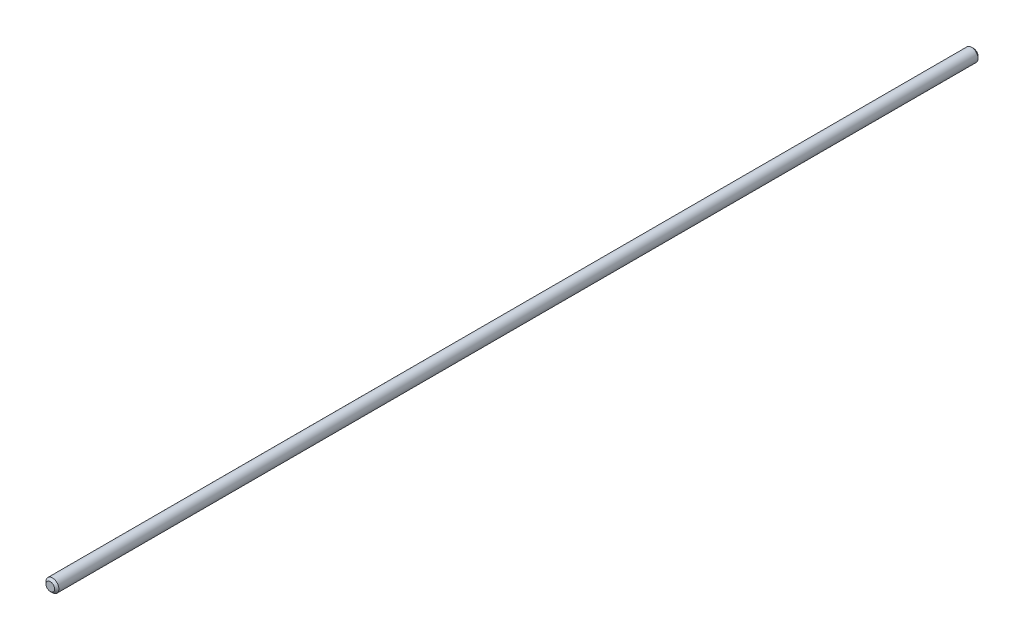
ISO-10303-21;
HEADER;
FILE_DESCRIPTION(('STEP AP214'),'2;1');
FILE_NAME('part.step','',(''),(''),'','','');
FILE_SCHEMA(('AUTOMOTIVE_DESIGN { 1 0 10303 214 1 1 1 1 }'));
ENDSEC;
DATA;
#1=APPLICATION_CONTEXT('core data for automotive mechanical design processes');
#2=APPLICATION_PROTOCOL_DEFINITION('international standard','automotive_design',2000,#1);
#3=PRODUCT_CONTEXT('',#1,'mechanical');
#4=PRODUCT('Part','Part','',(#3));
#5=PRODUCT_RELATED_PRODUCT_CATEGORY('part','',(#4));
#6=PRODUCT_DEFINITION_FORMATION('','',#4);
#7=PRODUCT_DEFINITION_CONTEXT('part definition',#1,'design');
#8=PRODUCT_DEFINITION('design','',#6,#7);
#9=PRODUCT_DEFINITION_SHAPE('','',#8);
#10=(LENGTH_UNIT() NAMED_UNIT(*) SI_UNIT(.MILLI.,.METRE.));
#11=(NAMED_UNIT(*) PLANE_ANGLE_UNIT() SI_UNIT($,.RADIAN.));
#12=(NAMED_UNIT(*) SI_UNIT($,.STERADIAN.) SOLID_ANGLE_UNIT());
#13=UNCERTAINTY_MEASURE_WITH_UNIT(LENGTH_MEASURE(1.E-05),#10,'distance_accuracy_value','');
#14=(GEOMETRIC_REPRESENTATION_CONTEXT(3) GLOBAL_UNCERTAINTY_ASSIGNED_CONTEXT((#13)) GLOBAL_UNIT_ASSIGNED_CONTEXT((#10,
#11,#12)) REPRESENTATION_CONTEXT('',''));
#15=CARTESIAN_POINT('',(0.,0.,0.));
#16=DIRECTION('',(0.,0.,1.));
#17=DIRECTION('',(1.,0.,0.));
#18=AXIS2_PLACEMENT_3D('',#15,#16,#17);
#19=CARTESIAN_POINT('',(0.,0.,430.));
#20=DIRECTION('',(0.,0.,-1.));
#21=DIRECTION('',(-1.,0.,0.));
#22=AXIS2_PLACEMENT_3D('',#19,#20,#21);
#23=CYLINDRICAL_SURFACE('',#22,3.);
#24=CARTESIAN_POINT('',(0.,0.,1.00000000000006));
#25=DIRECTION('',(0.,0.,1.));
#26=DIRECTION('',(1.,0.,0.));
#27=AXIS2_PLACEMENT_3D('',#24,#25,#26);
#28=CIRCLE('',#27,3.);
#29=CARTESIAN_POINT('',(3.,0.,1.00000000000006));
#30=VERTEX_POINT('',#29);
#31=EDGE_CURVE('E35',#30,#30,#28,.T.);
#32=ORIENTED_EDGE('',*,*,#31,.T.);
#33=EDGE_LOOP('',(#32));
#34=FACE_BOUND('',#33,.T.);
#35=CARTESIAN_POINT('',(0.,0.,429.));
#36=DIRECTION('',(0.,0.,1.));
#37=DIRECTION('',(1.,0.,0.));
#38=AXIS2_PLACEMENT_3D('',#35,#36,#37);
#39=CIRCLE('',#38,3.);
#40=CARTESIAN_POINT('',(3.,0.,429.));
#41=VERTEX_POINT('',#40);
#42=EDGE_CURVE('E39',#41,#41,#39,.F.);
#43=ORIENTED_EDGE('',*,*,#42,.T.);
#44=EDGE_LOOP('',(#43));
#45=FACE_BOUND('',#44,.T.);
#46=ADVANCED_FACE('F25',(#34,#45),#23,.T.);
#47=CARTESIAN_POINT('',(0.,0.,430.));
#48=DIRECTION('',(0.,0.,1.));
#49=DIRECTION('',(1.,0.,0.));
#50=AXIS2_PLACEMENT_3D('',#47,#48,#49);
#51=PLANE('',#50);
#52=CARTESIAN_POINT('',(0.,0.,430.));
#53=DIRECTION('',(0.,0.,1.));
#54=DIRECTION('',(1.,0.,0.));
#55=AXIS2_PLACEMENT_3D('',#52,#53,#54);
#56=CIRCLE('',#55,2.00000000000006);
#57=CARTESIAN_POINT('',(2.00000000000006,0.,430.));
#58=VERTEX_POINT('',#57);
#59=EDGE_CURVE('E10',#58,#58,#56,.T.);
#60=ORIENTED_EDGE('',*,*,#59,.T.);
#61=EDGE_LOOP('',(#60));
#62=FACE_BOUND('',#61,.T.);
#63=ADVANCED_FACE('F58',(#62),#51,.T.);
#64=CARTESIAN_POINT('',(0.,0.,0.));
#65=DIRECTION('',(0.,0.,1.));
#66=DIRECTION('',(1.,0.,0.));
#67=AXIS2_PLACEMENT_3D('',#64,#65,#66);
#68=PLANE('',#67);
#69=CARTESIAN_POINT('',(0.,0.,0.));
#70=DIRECTION('',(0.,0.,1.));
#71=DIRECTION('',(1.,0.,0.));
#72=AXIS2_PLACEMENT_3D('',#69,#70,#71);
#73=CIRCLE('',#72,1.99999999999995);
#74=CARTESIAN_POINT('',(1.99999999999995,0.,0.));
#75=VERTEX_POINT('',#74);
#76=EDGE_CURVE('E31',#75,#75,#73,.F.);
#77=ORIENTED_EDGE('',*,*,#76,.T.);
#78=EDGE_LOOP('',(#77));
#79=FACE_BOUND('',#78,.T.);
#80=ADVANCED_FACE('F54',(#79),#68,.F.);
#81=CARTESIAN_POINT('',(0.,0.,1.00000000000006));
#82=DIRECTION('',(0.,0.,1.));
#83=DIRECTION('',(1.,0.,0.));
#84=AXIS2_PLACEMENT_3D('',#81,#82,#83);
#85=CONICAL_SURFACE('',#84,3.,0.785398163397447);
#86=ORIENTED_EDGE('',*,*,#76,.F.);
#87=EDGE_LOOP('',(#86));
#88=FACE_BOUND('',#87,.T.);
#89=ORIENTED_EDGE('',*,*,#31,.F.);
#90=EDGE_LOOP('',(#89));
#91=FACE_BOUND('',#90,.T.);
#92=ADVANCED_FACE('F49',(#88,#91),#85,.T.);
#93=CARTESIAN_POINT('',(0.,0.,430.));
#94=DIRECTION('',(0.,0.,-1.));
#95=DIRECTION('',(-1.,0.,0.));
#96=AXIS2_PLACEMENT_3D('',#93,#94,#95);
#97=CONICAL_SURFACE('',#96,2.00000000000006,0.785398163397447);
#98=ORIENTED_EDGE('',*,*,#42,.F.);
#99=EDGE_LOOP('',(#98));
#100=FACE_BOUND('',#99,.T.);
#101=ORIENTED_EDGE('',*,*,#59,.F.);
#102=EDGE_LOOP('',(#101));
#103=FACE_BOUND('',#102,.T.);
#104=ADVANCED_FACE('F46',(#100,#103),#97,.T.);
#105=CLOSED_SHELL('',(#46,#63,#80,#92,#104));
#106=MANIFOLD_SOLID_BREP('B2',#105);
#107=ADVANCED_BREP_SHAPE_REPRESENTATION('',(#18,#106),#14);
#108=SHAPE_DEFINITION_REPRESENTATION(#9,#107);
ENDSEC;
END-ISO-10303-21;
